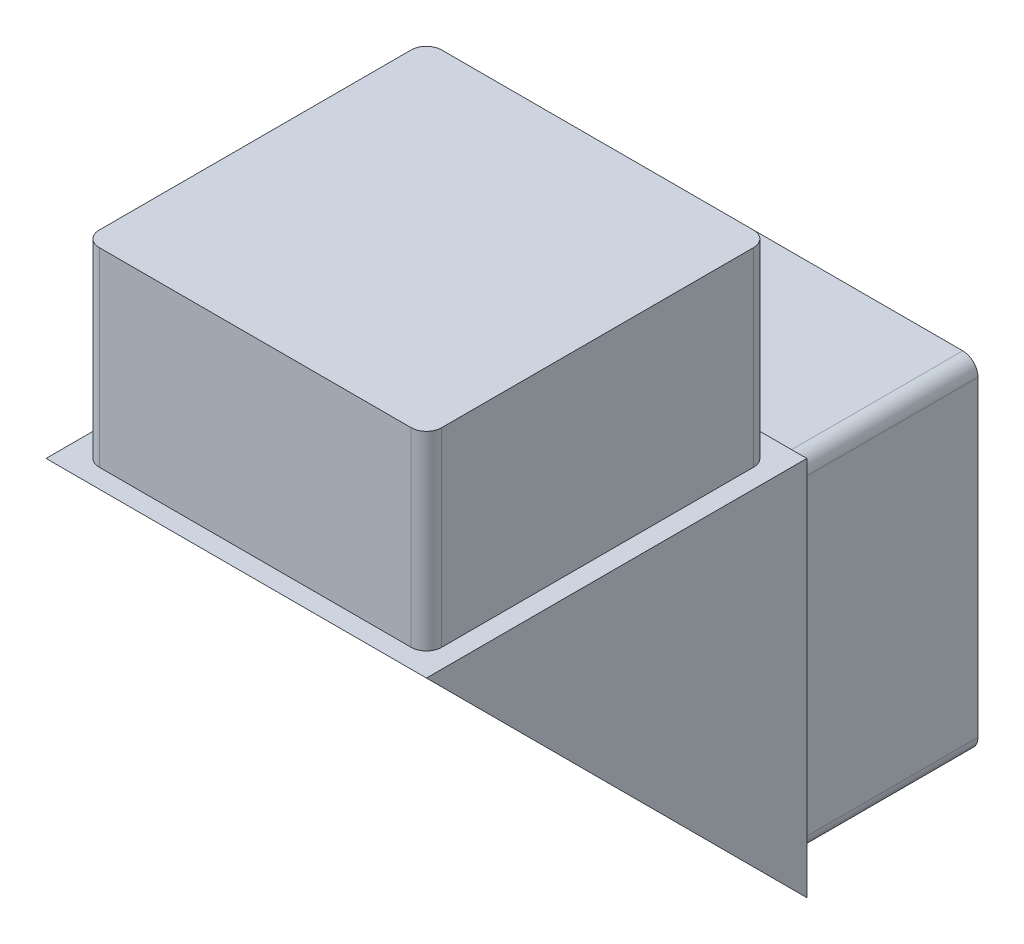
ISO-10303-21;
HEADER;
FILE_DESCRIPTION(('STEP AP214'),'2;1');
FILE_NAME('part.step','',(''),(''),'','','');
FILE_SCHEMA(('AUTOMOTIVE_DESIGN { 1 0 10303 214 1 1 1 1 }'));
ENDSEC;
DATA;
#1=APPLICATION_CONTEXT('core data for automotive mechanical design processes');
#2=APPLICATION_PROTOCOL_DEFINITION('international standard','automotive_design',2000,#1);
#3=PRODUCT_CONTEXT('',#1,'mechanical');
#4=PRODUCT('Part','Part','',(#3));
#5=PRODUCT_RELATED_PRODUCT_CATEGORY('part','',(#4));
#6=PRODUCT_DEFINITION_FORMATION('','',#4);
#7=PRODUCT_DEFINITION_CONTEXT('part definition',#1,'design');
#8=PRODUCT_DEFINITION('design','',#6,#7);
#9=PRODUCT_DEFINITION_SHAPE('','',#8);
#10=(LENGTH_UNIT() NAMED_UNIT(*) SI_UNIT(.MILLI.,.METRE.));
#11=(NAMED_UNIT(*) PLANE_ANGLE_UNIT() SI_UNIT($,.RADIAN.));
#12=(NAMED_UNIT(*) SI_UNIT($,.STERADIAN.) SOLID_ANGLE_UNIT());
#13=UNCERTAINTY_MEASURE_WITH_UNIT(LENGTH_MEASURE(1.E-05),#10,'distance_accuracy_value','');
#14=(GEOMETRIC_REPRESENTATION_CONTEXT(3) GLOBAL_UNCERTAINTY_ASSIGNED_CONTEXT((#13)) GLOBAL_UNIT_ASSIGNED_CONTEXT((#10,
#11,#12)) REPRESENTATION_CONTEXT('',''));
#15=CARTESIAN_POINT('',(0.,0.,0.));
#16=DIRECTION('',(0.,0.,1.));
#17=DIRECTION('',(1.,0.,0.));
#18=AXIS2_PLACEMENT_3D('',#15,#16,#17);
#19=CARTESIAN_POINT('',(10.,10.,-9.99999999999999));
#20=DIRECTION('',(0.,-1.,0.));
#21=DIRECTION('',(0.,0.,-1.));
#22=AXIS2_PLACEMENT_3D('',#19,#20,#21);
#23=PLANE('',#22);
#24=DIRECTION('',(0.,0.,-1.));
#25=VECTOR('',#24,1.);
#26=CARTESIAN_POINT('',(10.,10.,10.));
#27=LINE('',#26,#25);
#28=CARTESIAN_POINT('',(10.,10.,10.));
#29=VERTEX_POINT('',#28);
#30=CARTESIAN_POINT('',(10.,10.,-9.99999999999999));
#31=VERTEX_POINT('',#30);
#32=EDGE_CURVE('E184',#29,#31,#27,.T.);
#33=ORIENTED_EDGE('',*,*,#32,.T.);
#34=DIRECTION('',(-1.,0.,0.));
#35=VECTOR('',#34,1.);
#36=CARTESIAN_POINT('',(-10.,10.,-9.99999999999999));
#37=LINE('',#36,#35);
#38=CARTESIAN_POINT('',(-10.,10.,-9.99999999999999));
#39=VERTEX_POINT('',#38);
#40=EDGE_CURVE('E182',#31,#39,#37,.T.);
#41=ORIENTED_EDGE('',*,*,#40,.T.);
#42=DIRECTION('',(0.,0.,1.));
#43=VECTOR('',#42,1.);
#44=CARTESIAN_POINT('',(-10.,10.,10.));
#45=LINE('',#44,#43);
#46=CARTESIAN_POINT('',(-10.,10.,10.));
#47=VERTEX_POINT('',#46);
#48=EDGE_CURVE('E173',#39,#47,#45,.T.);
#49=ORIENTED_EDGE('',*,*,#48,.T.);
#50=DIRECTION('',(1.,0.,0.));
#51=VECTOR('',#50,1.);
#52=CARTESIAN_POINT('',(-10.,10.,10.));
#53=LINE('',#52,#51);
#54=EDGE_CURVE('E161',#47,#29,#53,.T.);
#55=ORIENTED_EDGE('',*,*,#54,.T.);
#56=EDGE_LOOP('',(#33,#41,#49,#55));
#57=FACE_BOUND('',#56,.T.);
#58=DIRECTION('',(0.,0.,-1.));
#59=VECTOR('',#58,1.);
#60=CARTESIAN_POINT('',(9.,10.,8.99999999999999));
#61=LINE('',#60,#59);
#62=CARTESIAN_POINT('',(9.,10.,8.19999999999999));
#63=VERTEX_POINT('',#62);
#64=CARTESIAN_POINT('',(9.,10.,-8.19999999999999));
#65=VERTEX_POINT('',#64);
#66=EDGE_CURVE('E262',#63,#65,#61,.T.);
#67=ORIENTED_EDGE('',*,*,#66,.F.);
#68=CARTESIAN_POINT('',(8.2,10.,8.19999999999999));
#69=DIRECTION('',(0.,-1.,0.));
#70=DIRECTION('',(0.,0.,-1.));
#71=AXIS2_PLACEMENT_3D('',#68,#69,#70);
#72=CIRCLE('',#71,0.8);
#73=CARTESIAN_POINT('',(8.2,10.,8.99999999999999));
#74=VERTEX_POINT('',#73);
#75=EDGE_CURVE('E40',#63,#74,#72,.T.);
#76=ORIENTED_EDGE('',*,*,#75,.T.);
#77=DIRECTION('',(1.,0.,0.));
#78=VECTOR('',#77,1.);
#79=CARTESIAN_POINT('',(-9.,10.,8.99999999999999));
#80=LINE('',#79,#78);
#81=CARTESIAN_POINT('',(-8.2,10.,8.99999999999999));
#82=VERTEX_POINT('',#81);
#83=EDGE_CURVE('E261',#82,#74,#80,.T.);
#84=ORIENTED_EDGE('',*,*,#83,.F.);
#85=CARTESIAN_POINT('',(-8.2,10.,8.19999999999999));
#86=DIRECTION('',(0.,-1.,0.));
#87=DIRECTION('',(0.,0.,-1.));
#88=AXIS2_PLACEMENT_3D('',#85,#86,#87);
#89=CIRCLE('',#88,0.8);
#90=CARTESIAN_POINT('',(-9.,10.,8.19999999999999));
#91=VERTEX_POINT('',#90);
#92=EDGE_CURVE('E258',#82,#91,#89,.T.);
#93=ORIENTED_EDGE('',*,*,#92,.T.);
#94=DIRECTION('',(0.,0.,1.));
#95=VECTOR('',#94,1.);
#96=CARTESIAN_POINT('',(-9.,10.,8.99999999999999));
#97=LINE('',#96,#95);
#98=CARTESIAN_POINT('',(-9.,10.,-8.19999999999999));
#99=VERTEX_POINT('',#98);
#100=EDGE_CURVE('E269',#99,#91,#97,.T.);
#101=ORIENTED_EDGE('',*,*,#100,.F.);
#102=CARTESIAN_POINT('',(-8.2,10.,-8.19999999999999));
#103=DIRECTION('',(0.,-1.,0.));
#104=DIRECTION('',(0.,0.,-1.));
#105=AXIS2_PLACEMENT_3D('',#102,#103,#104);
#106=CIRCLE('',#105,0.8);
#107=CARTESIAN_POINT('',(-8.2,10.,-8.99999999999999));
#108=VERTEX_POINT('',#107);
#109=EDGE_CURVE('E256',#99,#108,#106,.T.);
#110=ORIENTED_EDGE('',*,*,#109,.T.);
#111=DIRECTION('',(-1.,0.,0.));
#112=VECTOR('',#111,1.);
#113=CARTESIAN_POINT('',(-9.,10.,-8.99999999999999));
#114=LINE('',#113,#112);
#115=CARTESIAN_POINT('',(8.2,10.,-8.99999999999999));
#116=VERTEX_POINT('',#115);
#117=EDGE_CURVE('E293',#116,#108,#114,.T.);
#118=ORIENTED_EDGE('',*,*,#117,.F.);
#119=CARTESIAN_POINT('',(8.2,10.,-8.19999999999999));
#120=DIRECTION('',(0.,-1.,0.));
#121=DIRECTION('',(0.,0.,-1.));
#122=AXIS2_PLACEMENT_3D('',#119,#120,#121);
#123=CIRCLE('',#122,0.8);
#124=EDGE_CURVE('E11',#116,#65,#123,.T.);
#125=ORIENTED_EDGE('',*,*,#124,.T.);
#126=EDGE_LOOP('',(#67,#76,#84,#93,#101,#110,#118,#125));
#127=FACE_BOUND('',#126,.T.);
#128=ADVANCED_FACE('F32',(#57,#127),#23,.F.);
#129=CARTESIAN_POINT('',(-10.,10.,-9.99999999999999));
#130=DIRECTION('',(0.,0.,1.));
#131=DIRECTION('',(1.,0.,0.));
#132=AXIS2_PLACEMENT_3D('',#129,#130,#131);
#133=PLANE('',#132);
#134=DIRECTION('',(-1.,0.,0.));
#135=VECTOR('',#134,1.);
#136=CARTESIAN_POINT('',(-10.,-10.,-9.99999999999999));
#137=LINE('',#136,#135);
#138=CARTESIAN_POINT('',(10.,-10.,-9.99999999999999));
#139=VERTEX_POINT('',#138);
#140=CARTESIAN_POINT('',(-10.,-10.,-9.99999999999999));
#141=VERTEX_POINT('',#140);
#142=EDGE_CURVE('E180',#139,#141,#137,.T.);
#143=ORIENTED_EDGE('',*,*,#142,.T.);
#144=DIRECTION('',(0.,-1.,0.));
#145=VECTOR('',#144,1.);
#146=CARTESIAN_POINT('',(-10.,10.,-9.99999999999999));
#147=LINE('',#146,#145);
#148=EDGE_CURVE('E172',#39,#141,#147,.T.);
#149=ORIENTED_EDGE('',*,*,#148,.F.);
#150=ORIENTED_EDGE('',*,*,#40,.F.);
#151=DIRECTION('',(0.,-1.,0.));
#152=VECTOR('',#151,1.);
#153=CARTESIAN_POINT('',(10.,10.,-9.99999999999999));
#154=LINE('',#153,#152);
#155=EDGE_CURVE('E190',#31,#139,#154,.T.);
#156=ORIENTED_EDGE('',*,*,#155,.T.);
#157=EDGE_LOOP('',(#143,#149,#150,#156));
#158=FACE_BOUND('',#157,.T.);
#159=DIRECTION('',(0.,1.,0.));
#160=VECTOR('',#159,1.);
#161=CARTESIAN_POINT('',(-9.,-9.,-9.99999999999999));
#162=LINE('',#161,#160);
#163=CARTESIAN_POINT('',(-9.,-8.2,-9.99999999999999));
#164=VERTEX_POINT('',#163);
#165=CARTESIAN_POINT('',(-9.,8.2,-9.99999999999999));
#166=VERTEX_POINT('',#165);
#167=EDGE_CURVE('E291',#164,#166,#162,.T.);
#168=ORIENTED_EDGE('',*,*,#167,.F.);
#169=CARTESIAN_POINT('',(-8.2,-8.2,-9.99999999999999));
#170=DIRECTION('',(0.,0.,1.));
#171=DIRECTION('',(1.,0.,0.));
#172=AXIS2_PLACEMENT_3D('',#169,#170,#171);
#173=CIRCLE('',#172,0.8);
#174=CARTESIAN_POINT('',(-8.2,-9.,-9.99999999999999));
#175=VERTEX_POINT('',#174);
#176=EDGE_CURVE('E252',#164,#175,#173,.T.);
#177=ORIENTED_EDGE('',*,*,#176,.T.);
#178=DIRECTION('',(-1.,0.,0.));
#179=VECTOR('',#178,1.);
#180=CARTESIAN_POINT('',(9.,-9.,-9.99999999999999));
#181=LINE('',#180,#179);
#182=CARTESIAN_POINT('',(8.2,-9.,-9.99999999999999));
#183=VERTEX_POINT('',#182);
#184=EDGE_CURVE('E302',#183,#175,#181,.T.);
#185=ORIENTED_EDGE('',*,*,#184,.F.);
#186=CARTESIAN_POINT('',(8.2,-8.2,-9.99999999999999));
#187=DIRECTION('',(0.,0.,1.));
#188=DIRECTION('',(1.,0.,0.));
#189=AXIS2_PLACEMENT_3D('',#186,#187,#188);
#190=CIRCLE('',#189,0.8);
#191=CARTESIAN_POINT('',(9.,-8.2,-9.99999999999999));
#192=VERTEX_POINT('',#191);
#193=EDGE_CURVE('E248',#183,#192,#190,.T.);
#194=ORIENTED_EDGE('',*,*,#193,.T.);
#195=DIRECTION('',(0.,-1.,0.));
#196=VECTOR('',#195,1.);
#197=CARTESIAN_POINT('',(9.,-9.,-9.99999999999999));
#198=LINE('',#197,#196);
#199=CARTESIAN_POINT('',(9.,8.2,-9.99999999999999));
#200=VERTEX_POINT('',#199);
#201=EDGE_CURVE('E316',#200,#192,#198,.T.);
#202=ORIENTED_EDGE('',*,*,#201,.F.);
#203=CARTESIAN_POINT('',(8.2,8.2,-9.99999999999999));
#204=DIRECTION('',(0.,0.,1.));
#205=DIRECTION('',(1.,0.,0.));
#206=AXIS2_PLACEMENT_3D('',#203,#204,#205);
#207=CIRCLE('',#206,0.8);
#208=CARTESIAN_POINT('',(8.2,9.,-9.99999999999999));
#209=VERTEX_POINT('',#208);
#210=EDGE_CURVE('E250',#200,#209,#207,.T.);
#211=ORIENTED_EDGE('',*,*,#210,.T.);
#212=DIRECTION('',(1.,0.,0.));
#213=VECTOR('',#212,1.);
#214=CARTESIAN_POINT('',(9.,9.,-9.99999999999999));
#215=LINE('',#214,#213);
#216=CARTESIAN_POINT('',(-8.2,9.,-9.99999999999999));
#217=VERTEX_POINT('',#216);
#218=EDGE_CURVE('E313',#217,#209,#215,.T.);
#219=ORIENTED_EDGE('',*,*,#218,.F.);
#220=CARTESIAN_POINT('',(-8.2,8.2,-9.99999999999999));
#221=DIRECTION('',(0.,0.,1.));
#222=DIRECTION('',(1.,0.,0.));
#223=AXIS2_PLACEMENT_3D('',#220,#221,#222);
#224=CIRCLE('',#223,0.8);
#225=EDGE_CURVE('E254',#217,#166,#224,.T.);
#226=ORIENTED_EDGE('',*,*,#225,.T.);
#227=EDGE_LOOP('',(#168,#177,#185,#194,#202,#211,#219,#226));
#228=FACE_BOUND('',#227,.T.);
#229=ADVANCED_FACE('F325',(#158,#228),#133,.F.);
#230=CARTESIAN_POINT('',(10.,10.,10.));
#231=DIRECTION('',(-1.,0.,0.));
#232=DIRECTION('',(0.,0.,1.));
#233=AXIS2_PLACEMENT_3D('',#230,#231,#232);
#234=PLANE('',#233);
#235=ORIENTED_EDGE('',*,*,#32,.F.);
#236=DIRECTION('',(0.,0.707106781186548,0.707106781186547));
#237=VECTOR('',#236,1.);
#238=CARTESIAN_POINT('',(10.,10.,10.));
#239=LINE('',#238,#237);
#240=EDGE_CURVE('E167',#139,#29,#239,.T.);
#241=ORIENTED_EDGE('',*,*,#240,.F.);
#242=ORIENTED_EDGE('',*,*,#155,.F.);
#243=EDGE_LOOP('',(#235,#241,#242));
#244=FACE_BOUND('',#243,.T.);
#245=ADVANCED_FACE('F323',(#244),#234,.F.);
#246=CARTESIAN_POINT('',(-10.,10.,10.));
#247=DIRECTION('',(1.,0.,0.));
#248=DIRECTION('',(0.,0.,-1.));
#249=AXIS2_PLACEMENT_3D('',#246,#247,#248);
#250=PLANE('',#249);
#251=ORIENTED_EDGE('',*,*,#148,.T.);
#252=DIRECTION('',(0.,0.707106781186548,0.707106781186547));
#253=VECTOR('',#252,1.);
#254=CARTESIAN_POINT('',(-10.,10.,10.));
#255=LINE('',#254,#253);
#256=EDGE_CURVE('E164',#141,#47,#255,.T.);
#257=ORIENTED_EDGE('',*,*,#256,.T.);
#258=ORIENTED_EDGE('',*,*,#48,.F.);
#259=EDGE_LOOP('',(#251,#257,#258));
#260=FACE_BOUND('',#259,.T.);
#261=ADVANCED_FACE('F178',(#260),#250,.F.);
#262=CARTESIAN_POINT('',(-10.,10.,10.));
#263=DIRECTION('',(0.,0.707106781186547,-0.707106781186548));
#264=DIRECTION('',(0.,0.707106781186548,0.707106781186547));
#265=AXIS2_PLACEMENT_3D('',#262,#263,#264);
#266=PLANE('',#265);
#267=ORIENTED_EDGE('',*,*,#240,.T.);
#268=ORIENTED_EDGE('',*,*,#54,.F.);
#269=ORIENTED_EDGE('',*,*,#256,.F.);
#270=ORIENTED_EDGE('',*,*,#142,.F.);
#271=EDGE_LOOP('',(#267,#268,#269,#270));
#272=FACE_BOUND('',#271,.T.);
#273=ADVANCED_FACE('F163',(#272),#266,.F.);
#274=CARTESIAN_POINT('',(-9.,-9.,-20.));
#275=DIRECTION('',(1.,0.,0.));
#276=DIRECTION('',(0.,0.,-1.));
#277=AXIS2_PLACEMENT_3D('',#274,#275,#276);
#278=PLANE('',#277);
#279=DIRECTION('',(0.,1.,0.));
#280=VECTOR('',#279,1.);
#281=CARTESIAN_POINT('',(-9.,-9.,-20.));
#282=LINE('',#281,#280);
#283=CARTESIAN_POINT('',(-9.,-8.2,-20.));
#284=VERTEX_POINT('',#283);
#285=CARTESIAN_POINT('',(-9.,8.2,-20.));
#286=VERTEX_POINT('',#285);
#287=EDGE_CURVE('E298',#284,#286,#282,.T.);
#288=ORIENTED_EDGE('',*,*,#287,.F.);
#289=DIRECTION('',(0.,0.,1.));
#290=VECTOR('',#289,1.);
#291=CARTESIAN_POINT('',(-9.,-8.2,-20.));
#292=LINE('',#291,#290);
#293=EDGE_CURVE('E218',#284,#164,#292,.T.);
#294=ORIENTED_EDGE('',*,*,#293,.T.);
#295=ORIENTED_EDGE('',*,*,#167,.T.);
#296=DIRECTION('',(0.,0.,1.));
#297=VECTOR('',#296,1.);
#298=CARTESIAN_POINT('',(-9.,8.2,-20.));
#299=LINE('',#298,#297);
#300=EDGE_CURVE('E216',#166,#286,#299,.F.);
#301=ORIENTED_EDGE('',*,*,#300,.T.);
#302=EDGE_LOOP('',(#288,#294,#295,#301));
#303=FACE_BOUND('',#302,.T.);
#304=ADVANCED_FACE('F335',(#303),#278,.F.);
#305=CARTESIAN_POINT('',(9.,9.,-20.));
#306=DIRECTION('',(0.,-1.,0.));
#307=DIRECTION('',(0.,0.,-1.));
#308=AXIS2_PLACEMENT_3D('',#305,#306,#307);
#309=PLANE('',#308);
#310=ORIENTED_EDGE('',*,*,#218,.T.);
#311=DIRECTION('',(0.,0.,1.));
#312=VECTOR('',#311,1.);
#313=CARTESIAN_POINT('',(8.2,9.,-20.));
#314=LINE('',#313,#312);
#315=CARTESIAN_POINT('',(8.2,9.,-20.));
#316=VERTEX_POINT('',#315);
#317=EDGE_CURVE('E214',#209,#316,#314,.F.);
#318=ORIENTED_EDGE('',*,*,#317,.T.);
#319=DIRECTION('',(1.,0.,0.));
#320=VECTOR('',#319,1.);
#321=CARTESIAN_POINT('',(9.,9.,-20.));
#322=LINE('',#321,#320);
#323=CARTESIAN_POINT('',(-8.2,9.,-20.));
#324=VERTEX_POINT('',#323);
#325=EDGE_CURVE('E301',#324,#316,#322,.T.);
#326=ORIENTED_EDGE('',*,*,#325,.F.);
#327=DIRECTION('',(0.,0.,1.));
#328=VECTOR('',#327,1.);
#329=CARTESIAN_POINT('',(-8.2,9.,-20.));
#330=LINE('',#329,#328);
#331=EDGE_CURVE('E211',#324,#217,#330,.T.);
#332=ORIENTED_EDGE('',*,*,#331,.T.);
#333=EDGE_LOOP('',(#310,#318,#326,#332));
#334=FACE_BOUND('',#333,.T.);
#335=ADVANCED_FACE('F346',(#334),#309,.F.);
#336=CARTESIAN_POINT('',(9.,-9.,-20.));
#337=DIRECTION('',(-1.,0.,0.));
#338=DIRECTION('',(0.,0.,1.));
#339=AXIS2_PLACEMENT_3D('',#336,#337,#338);
#340=PLANE('',#339);
#341=ORIENTED_EDGE('',*,*,#201,.T.);
#342=DIRECTION('',(0.,0.,1.));
#343=VECTOR('',#342,1.);
#344=CARTESIAN_POINT('',(9.,-8.2,-20.));
#345=LINE('',#344,#343);
#346=CARTESIAN_POINT('',(9.,-8.2,-20.));
#347=VERTEX_POINT('',#346);
#348=EDGE_CURVE('E201',#192,#347,#345,.F.);
#349=ORIENTED_EDGE('',*,*,#348,.T.);
#350=DIRECTION('',(0.,-1.,0.));
#351=VECTOR('',#350,1.);
#352=CARTESIAN_POINT('',(9.,-9.,-20.));
#353=LINE('',#352,#351);
#354=CARTESIAN_POINT('',(9.,8.2,-20.));
#355=VERTEX_POINT('',#354);
#356=EDGE_CURVE('E305',#355,#347,#353,.T.);
#357=ORIENTED_EDGE('',*,*,#356,.F.);
#358=DIRECTION('',(0.,0.,1.));
#359=VECTOR('',#358,1.);
#360=CARTESIAN_POINT('',(9.,8.2,-20.));
#361=LINE('',#360,#359);
#362=EDGE_CURVE('E198',#355,#200,#361,.T.);
#363=ORIENTED_EDGE('',*,*,#362,.T.);
#364=EDGE_LOOP('',(#341,#349,#357,#363));
#365=FACE_BOUND('',#364,.T.);
#366=ADVANCED_FACE('F354',(#365),#340,.F.);
#367=CARTESIAN_POINT('',(9.,-9.,-20.));
#368=DIRECTION('',(0.,1.,0.));
#369=DIRECTION('',(0.,0.,1.));
#370=AXIS2_PLACEMENT_3D('',#367,#368,#369);
#371=PLANE('',#370);
#372=DIRECTION('',(-1.,0.,0.));
#373=VECTOR('',#372,1.);
#374=CARTESIAN_POINT('',(9.,-9.,-20.));
#375=LINE('',#374,#373);
#376=CARTESIAN_POINT('',(8.2,-9.,-20.));
#377=VERTEX_POINT('',#376);
#378=CARTESIAN_POINT('',(-8.2,-9.,-20.));
#379=VERTEX_POINT('',#378);
#380=EDGE_CURVE('E308',#377,#379,#375,.T.);
#381=ORIENTED_EDGE('',*,*,#380,.F.);
#382=DIRECTION('',(0.,0.,1.));
#383=VECTOR('',#382,1.);
#384=CARTESIAN_POINT('',(8.2,-9.,-20.));
#385=LINE('',#384,#383);
#386=EDGE_CURVE('E195',#377,#183,#385,.T.);
#387=ORIENTED_EDGE('',*,*,#386,.T.);
#388=ORIENTED_EDGE('',*,*,#184,.T.);
#389=DIRECTION('',(0.,0.,1.));
#390=VECTOR('',#389,1.);
#391=CARTESIAN_POINT('',(-8.2,-9.,-20.));
#392=LINE('',#391,#390);
#393=EDGE_CURVE('E193',#175,#379,#392,.F.);
#394=ORIENTED_EDGE('',*,*,#393,.T.);
#395=EDGE_LOOP('',(#381,#387,#388,#394));
#396=FACE_BOUND('',#395,.T.);
#397=ADVANCED_FACE('F363',(#396),#371,.F.);
#398=CARTESIAN_POINT('',(-9.,9.,-20.));
#399=DIRECTION('',(0.,0.,1.));
#400=DIRECTION('',(1.,0.,0.));
#401=AXIS2_PLACEMENT_3D('',#398,#399,#400);
#402=PLANE('',#401);
#403=ORIENTED_EDGE('',*,*,#356,.T.);
#404=CARTESIAN_POINT('',(8.2,-8.2,-20.));
#405=DIRECTION('',(0.,0.,1.));
#406=DIRECTION('',(1.,0.,0.));
#407=AXIS2_PLACEMENT_3D('',#404,#405,#406);
#408=CIRCLE('',#407,0.8);
#409=EDGE_CURVE('E209',#347,#377,#408,.F.);
#410=ORIENTED_EDGE('',*,*,#409,.T.);
#411=ORIENTED_EDGE('',*,*,#380,.T.);
#412=CARTESIAN_POINT('',(-8.2,-8.2,-20.));
#413=DIRECTION('',(0.,0.,1.));
#414=DIRECTION('',(1.,0.,0.));
#415=AXIS2_PLACEMENT_3D('',#412,#413,#414);
#416=CIRCLE('',#415,0.8);
#417=EDGE_CURVE('E205',#379,#284,#416,.F.);
#418=ORIENTED_EDGE('',*,*,#417,.T.);
#419=ORIENTED_EDGE('',*,*,#287,.T.);
#420=CARTESIAN_POINT('',(-8.2,8.2,-20.));
#421=DIRECTION('',(0.,0.,1.));
#422=DIRECTION('',(1.,0.,0.));
#423=AXIS2_PLACEMENT_3D('',#420,#421,#422);
#424=CIRCLE('',#423,0.8);
#425=EDGE_CURVE('E203',#286,#324,#424,.F.);
#426=ORIENTED_EDGE('',*,*,#425,.T.);
#427=ORIENTED_EDGE('',*,*,#325,.T.);
#428=CARTESIAN_POINT('',(8.2,8.2,-20.));
#429=DIRECTION('',(0.,0.,1.));
#430=DIRECTION('',(1.,0.,0.));
#431=AXIS2_PLACEMENT_3D('',#428,#429,#430);
#432=CIRCLE('',#431,0.8);
#433=EDGE_CURVE('E207',#316,#355,#432,.F.);
#434=ORIENTED_EDGE('',*,*,#433,.T.);
#435=EDGE_LOOP('',(#403,#410,#411,#418,#419,#426,#427,#434));
#436=FACE_BOUND('',#435,.T.);
#437=ADVANCED_FACE('F343',(#436),#402,.F.);
#438=CARTESIAN_POINT('',(9.,20.,8.99999999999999));
#439=DIRECTION('',(-1.,0.,0.));
#440=DIRECTION('',(0.,0.,1.));
#441=AXIS2_PLACEMENT_3D('',#438,#439,#440);
#442=PLANE('',#441);
#443=DIRECTION('',(0.,0.,-1.));
#444=VECTOR('',#443,1.);
#445=CARTESIAN_POINT('',(9.,20.,8.99999999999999));
#446=LINE('',#445,#444);
#447=CARTESIAN_POINT('',(9.,20.,8.19999999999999));
#448=VERTEX_POINT('',#447);
#449=CARTESIAN_POINT('',(9.,20.,-8.19999999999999));
#450=VERTEX_POINT('',#449);
#451=EDGE_CURVE('E268',#448,#450,#446,.T.);
#452=ORIENTED_EDGE('',*,*,#451,.F.);
#453=DIRECTION('',(0.,-1.,0.));
#454=VECTOR('',#453,1.);
#455=CARTESIAN_POINT('',(9.,20.,8.19999999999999));
#456=LINE('',#455,#454);
#457=EDGE_CURVE('E246',#448,#63,#456,.T.);
#458=ORIENTED_EDGE('',*,*,#457,.T.);
#459=ORIENTED_EDGE('',*,*,#66,.T.);
#460=DIRECTION('',(0.,-1.,0.));
#461=VECTOR('',#460,1.);
#462=CARTESIAN_POINT('',(9.,20.,-8.19999999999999));
#463=LINE('',#462,#461);
#464=EDGE_CURVE('E244',#65,#450,#463,.F.);
#465=ORIENTED_EDGE('',*,*,#464,.T.);
#466=EDGE_LOOP('',(#452,#458,#459,#465));
#467=FACE_BOUND('',#466,.T.);
#468=ADVANCED_FACE('F281',(#467),#442,.F.);
#469=CARTESIAN_POINT('',(-9.,20.,-8.99999999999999));
#470=DIRECTION('',(0.,0.,1.));
#471=DIRECTION('',(1.,0.,0.));
#472=AXIS2_PLACEMENT_3D('',#469,#470,#471);
#473=PLANE('',#472);
#474=ORIENTED_EDGE('',*,*,#117,.T.);
#475=DIRECTION('',(0.,-1.,0.));
#476=VECTOR('',#475,1.);
#477=CARTESIAN_POINT('',(-8.2,20.,-8.99999999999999));
#478=LINE('',#477,#476);
#479=CARTESIAN_POINT('',(-8.2,20.,-8.99999999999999));
#480=VERTEX_POINT('',#479);
#481=EDGE_CURVE('E229',#108,#480,#478,.F.);
#482=ORIENTED_EDGE('',*,*,#481,.T.);
#483=DIRECTION('',(-1.,0.,0.));
#484=VECTOR('',#483,1.);
#485=CARTESIAN_POINT('',(-9.,20.,-8.99999999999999));
#486=LINE('',#485,#484);
#487=CARTESIAN_POINT('',(8.2,20.,-8.99999999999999));
#488=VERTEX_POINT('',#487);
#489=EDGE_CURVE('E283',#488,#480,#486,.T.);
#490=ORIENTED_EDGE('',*,*,#489,.F.);
#491=DIRECTION('',(0.,-1.,0.));
#492=VECTOR('',#491,1.);
#493=CARTESIAN_POINT('',(8.2,20.,-8.99999999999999));
#494=LINE('',#493,#492);
#495=EDGE_CURVE('E226',#488,#116,#494,.T.);
#496=ORIENTED_EDGE('',*,*,#495,.T.);
#497=EDGE_LOOP('',(#474,#482,#490,#496));
#498=FACE_BOUND('',#497,.T.);
#499=ADVANCED_FACE('F400',(#498),#473,.F.);
#500=CARTESIAN_POINT('',(-9.,20.,8.99999999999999));
#501=DIRECTION('',(1.,0.,0.));
#502=DIRECTION('',(0.,0.,-1.));
#503=AXIS2_PLACEMENT_3D('',#500,#501,#502);
#504=PLANE('',#503);
#505=DIRECTION('',(0.,0.,1.));
#506=VECTOR('',#505,1.);
#507=CARTESIAN_POINT('',(-9.,20.,8.99999999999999));
#508=LINE('',#507,#506);
#509=CARTESIAN_POINT('',(-9.,20.,-8.19999999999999));
#510=VERTEX_POINT('',#509);
#511=CARTESIAN_POINT('',(-9.,20.,8.19999999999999));
#512=VERTEX_POINT('',#511);
#513=EDGE_CURVE('E285',#510,#512,#508,.T.);
#514=ORIENTED_EDGE('',*,*,#513,.F.);
#515=DIRECTION('',(0.,-1.,0.));
#516=VECTOR('',#515,1.);
#517=CARTESIAN_POINT('',(-9.,20.,-8.19999999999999));
#518=LINE('',#517,#516);
#519=EDGE_CURVE('E223',#510,#99,#518,.T.);
#520=ORIENTED_EDGE('',*,*,#519,.T.);
#521=ORIENTED_EDGE('',*,*,#100,.T.);
#522=DIRECTION('',(0.,-1.,0.));
#523=VECTOR('',#522,1.);
#524=CARTESIAN_POINT('',(-9.,20.,8.19999999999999));
#525=LINE('',#524,#523);
#526=EDGE_CURVE('E221',#91,#512,#525,.F.);
#527=ORIENTED_EDGE('',*,*,#526,.T.);
#528=EDGE_LOOP('',(#514,#520,#521,#527));
#529=FACE_BOUND('',#528,.T.);
#530=ADVANCED_FACE('F395',(#529),#504,.F.);
#531=CARTESIAN_POINT('',(-9.,20.,8.99999999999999));
#532=DIRECTION('',(0.,0.,-1.));
#533=DIRECTION('',(-1.,0.,0.));
#534=AXIS2_PLACEMENT_3D('',#531,#532,#533);
#535=PLANE('',#534);
#536=DIRECTION('',(1.,0.,0.));
#537=VECTOR('',#536,1.);
#538=CARTESIAN_POINT('',(-9.,20.,8.99999999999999));
#539=LINE('',#538,#537);
#540=CARTESIAN_POINT('',(-8.2,20.,8.99999999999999));
#541=VERTEX_POINT('',#540);
#542=CARTESIAN_POINT('',(8.2,20.,8.99999999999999));
#543=VERTEX_POINT('',#542);
#544=EDGE_CURVE('E279',#541,#543,#539,.T.);
#545=ORIENTED_EDGE('',*,*,#544,.F.);
#546=DIRECTION('',(0.,-1.,0.));
#547=VECTOR('',#546,1.);
#548=CARTESIAN_POINT('',(-8.2,20.,8.99999999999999));
#549=LINE('',#548,#547);
#550=EDGE_CURVE('E241',#541,#82,#549,.T.);
#551=ORIENTED_EDGE('',*,*,#550,.T.);
#552=ORIENTED_EDGE('',*,*,#83,.T.);
#553=DIRECTION('',(0.,-1.,0.));
#554=VECTOR('',#553,1.);
#555=CARTESIAN_POINT('',(8.2,20.,8.99999999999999));
#556=LINE('',#555,#554);
#557=EDGE_CURVE('E239',#74,#543,#556,.F.);
#558=ORIENTED_EDGE('',*,*,#557,.T.);
#559=EDGE_LOOP('',(#545,#551,#552,#558));
#560=FACE_BOUND('',#559,.T.);
#561=ADVANCED_FACE('F265',(#560),#535,.F.);
#562=CARTESIAN_POINT('',(9.,20.,-8.99999999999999));
#563=DIRECTION('',(0.,-1.,0.));
#564=DIRECTION('',(0.,0.,-1.));
#565=AXIS2_PLACEMENT_3D('',#562,#563,#564);
#566=PLANE('',#565);
#567=ORIENTED_EDGE('',*,*,#489,.T.);
#568=CARTESIAN_POINT('',(-8.2,20.,-8.19999999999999));
#569=DIRECTION('',(0.,-1.,0.));
#570=DIRECTION('',(0.,0.,-1.));
#571=AXIS2_PLACEMENT_3D('',#568,#569,#570);
#572=CIRCLE('',#571,0.8);
#573=EDGE_CURVE('E237',#480,#510,#572,.F.);
#574=ORIENTED_EDGE('',*,*,#573,.T.);
#575=ORIENTED_EDGE('',*,*,#513,.T.);
#576=CARTESIAN_POINT('',(-8.2,20.,8.19999999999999));
#577=DIRECTION('',(0.,-1.,0.));
#578=DIRECTION('',(0.,0.,-1.));
#579=AXIS2_PLACEMENT_3D('',#576,#577,#578);
#580=CIRCLE('',#579,0.8);
#581=EDGE_CURVE('E235',#512,#541,#580,.F.);
#582=ORIENTED_EDGE('',*,*,#581,.T.);
#583=ORIENTED_EDGE('',*,*,#544,.T.);
#584=CARTESIAN_POINT('',(8.2,20.,8.19999999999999));
#585=DIRECTION('',(0.,-1.,0.));
#586=DIRECTION('',(0.,0.,-1.));
#587=AXIS2_PLACEMENT_3D('',#584,#585,#586);
#588=CIRCLE('',#587,0.8);
#589=EDGE_CURVE('E233',#543,#448,#588,.F.);
#590=ORIENTED_EDGE('',*,*,#589,.T.);
#591=ORIENTED_EDGE('',*,*,#451,.T.);
#592=CARTESIAN_POINT('',(8.2,20.,-8.19999999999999));
#593=DIRECTION('',(0.,-1.,0.));
#594=DIRECTION('',(0.,0.,-1.));
#595=AXIS2_PLACEMENT_3D('',#592,#593,#594);
#596=CIRCLE('',#595,0.8);
#597=EDGE_CURVE('E231',#450,#488,#596,.F.);
#598=ORIENTED_EDGE('',*,*,#597,.T.);
#599=EDGE_LOOP('',(#567,#574,#575,#582,#583,#590,#591,#598));
#600=FACE_BOUND('',#599,.T.);
#601=ADVANCED_FACE('F277',(#600),#566,.F.);
#602=CARTESIAN_POINT('',(8.2,-8.2,-20.));
#603=DIRECTION('',(0.,0.,1.));
#604=DIRECTION('',(1.,0.,0.));
#605=AXIS2_PLACEMENT_3D('',#602,#603,#604);
#606=CYLINDRICAL_SURFACE('',#605,0.8);
#607=ORIENTED_EDGE('',*,*,#409,.F.);
#608=ORIENTED_EDGE('',*,*,#348,.F.);
#609=ORIENTED_EDGE('',*,*,#193,.F.);
#610=ORIENTED_EDGE('',*,*,#386,.F.);
#611=EDGE_LOOP('',(#607,#608,#609,#610));
#612=FACE_BOUND('',#611,.T.);
#613=ADVANCED_FACE('F358',(#612),#606,.T.);
#614=CARTESIAN_POINT('',(8.2,8.2,-20.));
#615=DIRECTION('',(0.,0.,1.));
#616=DIRECTION('',(1.,0.,0.));
#617=AXIS2_PLACEMENT_3D('',#614,#615,#616);
#618=CYLINDRICAL_SURFACE('',#617,0.8);
#619=ORIENTED_EDGE('',*,*,#433,.F.);
#620=ORIENTED_EDGE('',*,*,#317,.F.);
#621=ORIENTED_EDGE('',*,*,#210,.F.);
#622=ORIENTED_EDGE('',*,*,#362,.F.);
#623=EDGE_LOOP('',(#619,#620,#621,#622));
#624=FACE_BOUND('',#623,.T.);
#625=ADVANCED_FACE('F349',(#624),#618,.T.);
#626=CARTESIAN_POINT('',(-8.2,-8.2,-20.));
#627=DIRECTION('',(0.,0.,1.));
#628=DIRECTION('',(1.,0.,0.));
#629=AXIS2_PLACEMENT_3D('',#626,#627,#628);
#630=CYLINDRICAL_SURFACE('',#629,0.8);
#631=ORIENTED_EDGE('',*,*,#417,.F.);
#632=ORIENTED_EDGE('',*,*,#393,.F.);
#633=ORIENTED_EDGE('',*,*,#176,.F.);
#634=ORIENTED_EDGE('',*,*,#293,.F.);
#635=EDGE_LOOP('',(#631,#632,#633,#634));
#636=FACE_BOUND('',#635,.T.);
#637=ADVANCED_FACE('F366',(#636),#630,.T.);
#638=CARTESIAN_POINT('',(-8.2,8.2,-20.));
#639=DIRECTION('',(0.,0.,1.));
#640=DIRECTION('',(1.,0.,0.));
#641=AXIS2_PLACEMENT_3D('',#638,#639,#640);
#642=CYLINDRICAL_SURFACE('',#641,0.8);
#643=ORIENTED_EDGE('',*,*,#425,.F.);
#644=ORIENTED_EDGE('',*,*,#300,.F.);
#645=ORIENTED_EDGE('',*,*,#225,.F.);
#646=ORIENTED_EDGE('',*,*,#331,.F.);
#647=EDGE_LOOP('',(#643,#644,#645,#646));
#648=FACE_BOUND('',#647,.T.);
#649=ADVANCED_FACE('F339',(#648),#642,.T.);
#650=CARTESIAN_POINT('',(-8.2,20.,-8.19999999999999));
#651=DIRECTION('',(0.,-1.,0.));
#652=DIRECTION('',(0.,0.,-1.));
#653=AXIS2_PLACEMENT_3D('',#650,#651,#652);
#654=CYLINDRICAL_SURFACE('',#653,0.8);
#655=ORIENTED_EDGE('',*,*,#573,.F.);
#656=ORIENTED_EDGE('',*,*,#481,.F.);
#657=ORIENTED_EDGE('',*,*,#109,.F.);
#658=ORIENTED_EDGE('',*,*,#519,.F.);
#659=EDGE_LOOP('',(#655,#656,#657,#658));
#660=FACE_BOUND('',#659,.T.);
#661=ADVANCED_FACE('F373',(#660),#654,.T.);
#662=CARTESIAN_POINT('',(-8.2,20.,8.19999999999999));
#663=DIRECTION('',(0.,-1.,0.));
#664=DIRECTION('',(0.,0.,-1.));
#665=AXIS2_PLACEMENT_3D('',#662,#663,#664);
#666=CYLINDRICAL_SURFACE('',#665,0.8);
#667=ORIENTED_EDGE('',*,*,#581,.F.);
#668=ORIENTED_EDGE('',*,*,#526,.F.);
#669=ORIENTED_EDGE('',*,*,#92,.F.);
#670=ORIENTED_EDGE('',*,*,#550,.F.);
#671=EDGE_LOOP('',(#667,#668,#669,#670));
#672=FACE_BOUND('',#671,.T.);
#673=ADVANCED_FACE('F519',(#672),#666,.T.);
#674=CARTESIAN_POINT('',(8.2,20.,8.19999999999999));
#675=DIRECTION('',(0.,-1.,0.));
#676=DIRECTION('',(0.,0.,-1.));
#677=AXIS2_PLACEMENT_3D('',#674,#675,#676);
#678=CYLINDRICAL_SURFACE('',#677,0.8);
#679=ORIENTED_EDGE('',*,*,#589,.F.);
#680=ORIENTED_EDGE('',*,*,#557,.F.);
#681=ORIENTED_EDGE('',*,*,#75,.F.);
#682=ORIENTED_EDGE('',*,*,#457,.F.);
#683=EDGE_LOOP('',(#679,#680,#681,#682));
#684=FACE_BOUND('',#683,.T.);
#685=ADVANCED_FACE('F272',(#684),#678,.T.);
#686=CARTESIAN_POINT('',(8.2,20.,-8.19999999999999));
#687=DIRECTION('',(0.,-1.,0.));
#688=DIRECTION('',(0.,0.,-1.));
#689=AXIS2_PLACEMENT_3D('',#686,#687,#688);
#690=CYLINDRICAL_SURFACE('',#689,0.8);
#691=ORIENTED_EDGE('',*,*,#597,.F.);
#692=ORIENTED_EDGE('',*,*,#464,.F.);
#693=ORIENTED_EDGE('',*,*,#124,.F.);
#694=ORIENTED_EDGE('',*,*,#495,.F.);
#695=EDGE_LOOP('',(#691,#692,#693,#694));
#696=FACE_BOUND('',#695,.T.);
#697=ADVANCED_FACE('F34',(#696),#690,.T.);
#698=CLOSED_SHELL('',(#128,#229,#245,#261,#273,#304,#335,#366,#397,#437,#468,#499,#530,#561,
#601,#613,#625,#637,#649,#661,#673,#685,#697));
#699=MANIFOLD_SOLID_BREP('B2',#698);
#700=ADVANCED_BREP_SHAPE_REPRESENTATION('',(#18,#699),#14);
#701=SHAPE_DEFINITION_REPRESENTATION(#9,#700);
ENDSEC;
END-ISO-10303-21;
